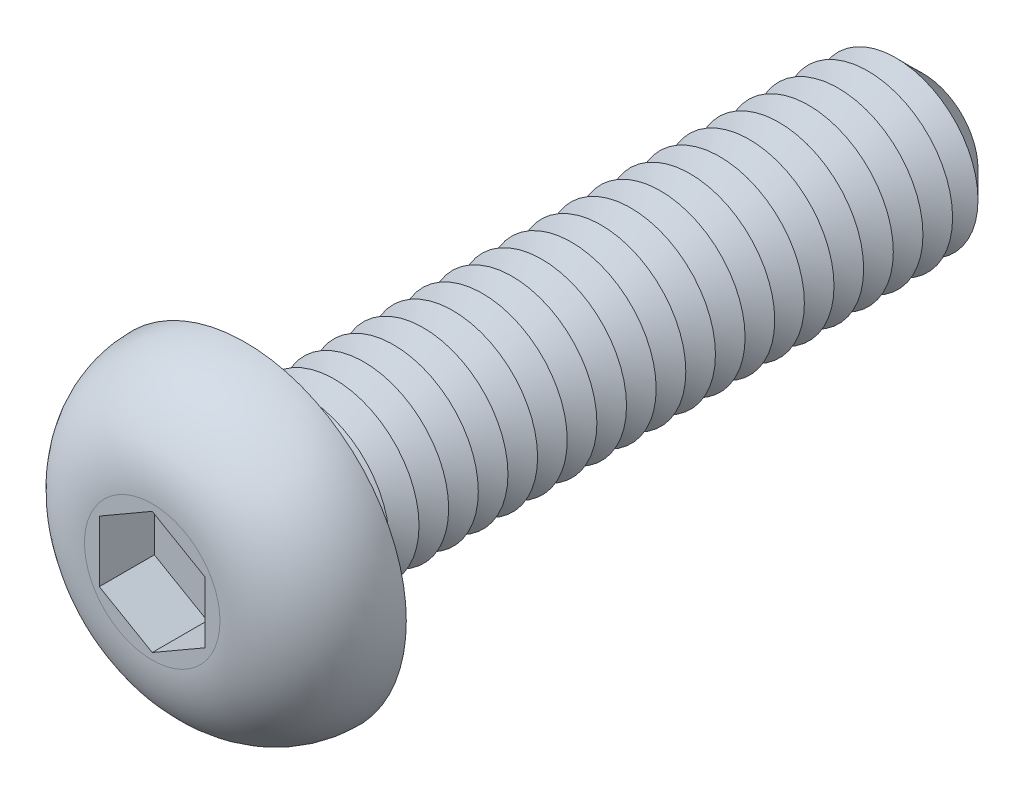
from build123d import *

# Parameters (mm, degrees)
CUT_EXTRUDE1_DEPTH  = 1.3
SKETCH4_R           = 2
BOSS_EXTRUDE1_DEPTH = 16
CHAMFER1_SIZE       = 0.7
LPATTERN1_COUNT     = 21
LPATTERN1_PITCH     = 0.7
FILLET2_R           = 0.35
SKETCH6_R           = 0.5
CUT_EXTRUDE2_DEPTH  = 16.9


with BuildPart() as part:
    # Sketch2 → Revolve1 (revolve)
    with BuildSketch(Plane(origin=(0, 0, 0), x_dir=(0, 0, -1), z_dir=(1, 0, 0)), mode=Mode.PRIVATE) as revolve1_sk:
        with BuildLine():
            Line((0, 0), (-2.2, 0))
            Line((-2.2, 0), (-2.2, 1.6))
            ThreePointArc((-2.2, 1.6), (-1.555634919, 3.155634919), (0, 3.8))
            Line((0, 3.8), (0, 0))
        make_face()
    revolve(revolve1_sk.sketch.rotate(Axis((0, 0, 47.934239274), (0, 0, -1)), 90), axis=Axis((0, 0, 47.934239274), (0, 0, -1)))

    # Sketch3 → Cut-Extrude1 (cut)
    with BuildSketch(Plane.XY.offset(2.2)):
        Polygon((0, 1.443375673), (-1.25, 0.721687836), (-1.25, -0.721687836), (0, -1.443375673), (1.25, -0.721687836), (1.25, 0.721687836), align=None)
    extrude(amount=-CUT_EXTRUDE1_DEPTH, mode=Mode.SUBTRACT)

    # Sketch4 → Boss-Extrude1 (add)
    with BuildSketch(Plane(origin=(0, 0, 0), x_dir=(-1, 0, 0), z_dir=(0, 0, -1))):
        with Locations(Location((0, 0, 0), (0, 0, 180))):
            Circle(SKETCH4_R)
    extrude(amount=BOSS_EXTRUDE1_DEPTH)

    # Chamfer1
    chamfer1_edges = [part.edges().sort_by_distance(p)[0] for p in [
        (-2, 0, -16),
    ]]
    chamfer(chamfer1_edges, length=CHAMFER1_SIZE)

    # Sketch5 → Cut-Revolve1 (revolve, cut)
    with BuildSketch(Plane(origin=(0, 0, 0), x_dir=(0, 0, -1), z_dir=(1, 0, 0)), mode=Mode.PRIVATE) as cut_revolve1_sk:
        Polygon((0.7, 2), (1.4, 2), (1.05, 1.393782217), align=None)
    cut_revolve1 = revolve(cut_revolve1_sk.sketch.rotate(Axis((0, 0, 47.934239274), (0, 0, -1)), 90), axis=Axis((0, 0, 47.934239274), (0, 0, -1)), mode=Mode.SUBTRACT)

    # LPattern1: Cut-Revolve1 ×21
    with Locations(*[(0, 0, -i * LPATTERN1_PITCH) for i in range(1, LPATTERN1_COUNT)]):
        add(cut_revolve1, mode=Mode.SUBTRACT)

    # Fillet2
    fillet2_edges = [part.edges().sort_by_distance(p)[0] for p in [
        (-2, 0, 0),
    ]]
    fillet(fillet2_edges, radius=FILLET2_R)

    # Sketch6 → Cut-Extrude2 (cut)
    with BuildSketch(Plane.XY.offset(0.9)):
        Circle(SKETCH6_R)
    extrude(amount=-CUT_EXTRUDE2_DEPTH, mode=Mode.SUBTRACT)


solid = part.part
